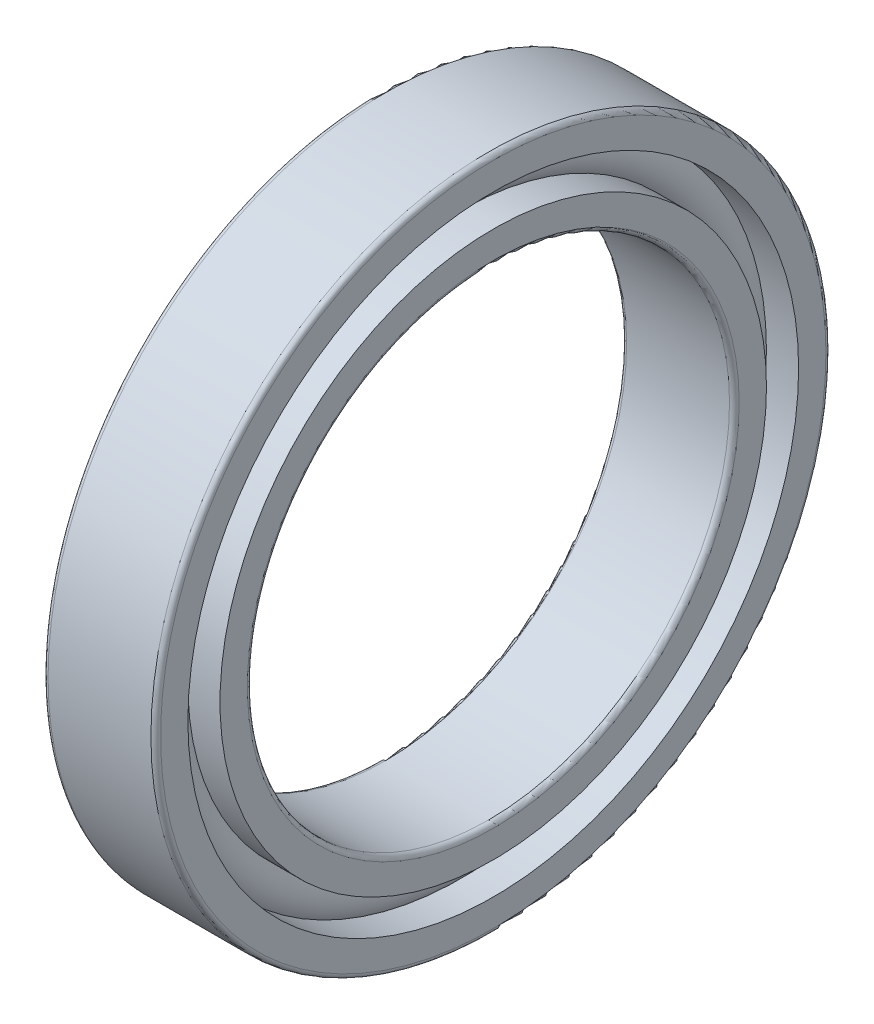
ISO-10303-21;
HEADER;
FILE_DESCRIPTION(('STEP AP214'),'2;1');
FILE_NAME('part.step','',(''),(''),'','','');
FILE_SCHEMA(('AUTOMOTIVE_DESIGN { 1 0 10303 214 1 1 1 1 }'));
ENDSEC;
DATA;
#1=APPLICATION_CONTEXT('core data for automotive mechanical design processes');
#2=APPLICATION_PROTOCOL_DEFINITION('international standard','automotive_design',2000,#1);
#3=PRODUCT_CONTEXT('',#1,'mechanical');
#4=PRODUCT('Part','Part','',(#3));
#5=PRODUCT_RELATED_PRODUCT_CATEGORY('part','',(#4));
#6=PRODUCT_DEFINITION_FORMATION('','',#4);
#7=PRODUCT_DEFINITION_CONTEXT('part definition',#1,'design');
#8=PRODUCT_DEFINITION('design','',#6,#7);
#9=PRODUCT_DEFINITION_SHAPE('','',#8);
#10=(LENGTH_UNIT() NAMED_UNIT(*) SI_UNIT(.MILLI.,.METRE.));
#11=(NAMED_UNIT(*) PLANE_ANGLE_UNIT() SI_UNIT($,.RADIAN.));
#12=(NAMED_UNIT(*) SI_UNIT($,.STERADIAN.) SOLID_ANGLE_UNIT());
#13=UNCERTAINTY_MEASURE_WITH_UNIT(LENGTH_MEASURE(1.E-05),#10,'distance_accuracy_value','');
#14=(GEOMETRIC_REPRESENTATION_CONTEXT(3) GLOBAL_UNCERTAINTY_ASSIGNED_CONTEXT((#13)) GLOBAL_UNIT_ASSIGNED_CONTEXT((#10,
#11,#12)) REPRESENTATION_CONTEXT('',''));
#15=CARTESIAN_POINT('',(0.,0.,0.));
#16=DIRECTION('',(0.,0.,1.));
#17=DIRECTION('',(1.,0.,0.));
#18=AXIS2_PLACEMENT_3D('',#15,#16,#17);
#19=CARTESIAN_POINT('',(0.29999999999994,0.,0.));
#20=DIRECTION('',(1.,0.,0.));
#21=DIRECTION('',(0.,0.,-1.));
#22=AXIS2_PLACEMENT_3D('',#19,#20,#21);
#23=TOROIDAL_SURFACE('',#22,20.7000000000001,0.29999999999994);
#24=CARTESIAN_POINT('',(0.,0.,0.));
#25=DIRECTION('',(1.,0.,0.));
#26=DIRECTION('',(0.,0.,-1.));
#27=AXIS2_PLACEMENT_3D('',#24,#25,#26);
#28=CIRCLE('',#27,20.7);
#29=CARTESIAN_POINT('',(0.,0.,-20.7));
#30=VERTEX_POINT('',#29);
#31=EDGE_CURVE('E10',#30,#30,#28,.T.);
#32=ORIENTED_EDGE('',*,*,#31,.T.);
#33=EDGE_LOOP('',(#32));
#34=FACE_BOUND('',#33,.T.);
#35=CARTESIAN_POINT('',(0.3,0.,0.));
#36=DIRECTION('',(1.,0.,0.));
#37=DIRECTION('',(0.,0.,-1.));
#38=AXIS2_PLACEMENT_3D('',#35,#36,#37);
#39=CIRCLE('',#38,21.);
#40=CARTESIAN_POINT('',(0.3,0.,-21.));
#41=VERTEX_POINT('',#40);
#42=EDGE_CURVE('E81',#41,#41,#39,.T.);
#43=ORIENTED_EDGE('',*,*,#42,.F.);
#44=EDGE_LOOP('',(#43));
#45=FACE_BOUND('',#44,.T.);
#46=ADVANCED_FACE('F29',(#34,#45),#23,.T.);
#47=CARTESIAN_POINT('',(0.,20.7,0.));
#48=DIRECTION('',(-1.,0.,0.));
#49=DIRECTION('',(0.,0.,1.));
#50=AXIS2_PLACEMENT_3D('',#47,#48,#49);
#51=PLANE('',#50);
#52=CARTESIAN_POINT('',(0.,0.,0.));
#53=DIRECTION('',(1.,0.,0.));
#54=DIRECTION('',(0.,0.,-1.));
#55=AXIS2_PLACEMENT_3D('',#52,#53,#54);
#56=CIRCLE('',#55,19.);
#57=CARTESIAN_POINT('',(0.,0.,-19.));
#58=VERTEX_POINT('',#57);
#59=EDGE_CURVE('E35',#58,#58,#56,.T.);
#60=ORIENTED_EDGE('',*,*,#59,.T.);
#61=EDGE_LOOP('',(#60));
#62=FACE_BOUND('',#61,.T.);
#63=ORIENTED_EDGE('',*,*,#31,.F.);
#64=EDGE_LOOP('',(#63));
#65=FACE_BOUND('',#64,.T.);
#66=ADVANCED_FACE('F89',(#62,#65),#51,.T.);
#67=CARTESIAN_POINT('',(7.,0.,0.));
#68=DIRECTION('',(1.,0.,0.));
#69=DIRECTION('',(0.,0.,-1.));
#70=AXIS2_PLACEMENT_3D('',#67,#68,#69);
#71=CYLINDRICAL_SURFACE('',#70,19.);
#72=CARTESIAN_POINT('',(2.0033370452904,0.,0.));
#73=DIRECTION('',(1.,0.,0.));
#74=DIRECTION('',(0.,0.,-1.));
#75=AXIS2_PLACEMENT_3D('',#72,#73,#74);
#76=CIRCLE('',#75,19.);
#77=CARTESIAN_POINT('',(2.0033370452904,0.,-19.));
#78=VERTEX_POINT('',#77);
#79=EDGE_CURVE('E39',#78,#78,#76,.T.);
#80=ORIENTED_EDGE('',*,*,#79,.T.);
#81=EDGE_LOOP('',(#80));
#82=FACE_BOUND('',#81,.T.);
#83=ORIENTED_EDGE('',*,*,#59,.F.);
#84=EDGE_LOOP('',(#83));
#85=FACE_BOUND('',#84,.T.);
#86=ADVANCED_FACE('F93',(#82,#85),#71,.F.);
#87=CARTESIAN_POINT('',(3.50000000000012,0.,0.));
#88=DIRECTION('',(1.,0.,0.));
#89=DIRECTION('',(0.,0.,-1.));
#90=AXIS2_PLACEMENT_3D('',#87,#88,#89);
#91=TOROIDAL_SURFACE('',#90,18.,1.80000000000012);
#92=CARTESIAN_POINT('',(2.0033370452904,0.,0.));
#93=DIRECTION('',(1.,0.,0.));
#94=DIRECTION('',(0.,0.,-1.));
#95=AXIS2_PLACEMENT_3D('',#92,#93,#94);
#96=CIRCLE('',#95,17.);
#97=CARTESIAN_POINT('',(2.0033370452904,0.,-17.));
#98=VERTEX_POINT('',#97);
#99=EDGE_CURVE('E43',#98,#98,#96,.T.);
#100=ORIENTED_EDGE('',*,*,#99,.T.);
#101=EDGE_LOOP('',(#100));
#102=FACE_BOUND('',#101,.T.);
#103=ORIENTED_EDGE('',*,*,#79,.F.);
#104=EDGE_LOOP('',(#103));
#105=FACE_BOUND('',#104,.T.);
#106=ADVANCED_FACE('F97',(#102,#105),#91,.T.);
#107=CARTESIAN_POINT('',(7.,0.,0.));
#108=DIRECTION('',(1.,0.,0.));
#109=DIRECTION('',(0.,0.,-1.));
#110=AXIS2_PLACEMENT_3D('',#107,#108,#109);
#111=CYLINDRICAL_SURFACE('',#110,17.);
#112=CARTESIAN_POINT('',(0.,0.,0.));
#113=DIRECTION('',(1.,0.,0.));
#114=DIRECTION('',(0.,0.,-1.));
#115=AXIS2_PLACEMENT_3D('',#112,#113,#114);
#116=CIRCLE('',#115,17.);
#117=CARTESIAN_POINT('',(0.,0.,-17.));
#118=VERTEX_POINT('',#117);
#119=EDGE_CURVE('E48',#118,#118,#116,.T.);
#120=ORIENTED_EDGE('',*,*,#119,.T.);
#121=EDGE_LOOP('',(#120));
#122=FACE_BOUND('',#121,.T.);
#123=ORIENTED_EDGE('',*,*,#99,.F.);
#124=EDGE_LOOP('',(#123));
#125=FACE_BOUND('',#124,.T.);
#126=ADVANCED_FACE('F104',(#122,#125),#111,.T.);
#127=CARTESIAN_POINT('',(0.,17.,0.));
#128=DIRECTION('',(-1.,0.,0.));
#129=DIRECTION('',(0.,0.,1.));
#130=AXIS2_PLACEMENT_3D('',#127,#128,#129);
#131=PLANE('',#130);
#132=CARTESIAN_POINT('',(0.,0.,0.));
#133=DIRECTION('',(1.,0.,0.));
#134=DIRECTION('',(0.,0.,-1.));
#135=AXIS2_PLACEMENT_3D('',#132,#133,#134);
#136=CIRCLE('',#135,15.3);
#137=CARTESIAN_POINT('',(0.,0.,-15.3));
#138=VERTEX_POINT('',#137);
#139=EDGE_CURVE('E51',#138,#138,#136,.T.);
#140=ORIENTED_EDGE('',*,*,#139,.T.);
#141=EDGE_LOOP('',(#140));
#142=FACE_BOUND('',#141,.T.);
#143=ORIENTED_EDGE('',*,*,#119,.F.);
#144=EDGE_LOOP('',(#143));
#145=FACE_BOUND('',#144,.T.);
#146=ADVANCED_FACE('F108',(#142,#145),#131,.T.);
#147=CARTESIAN_POINT('',(0.299999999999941,0.,0.));
#148=DIRECTION('',(1.,0.,0.));
#149=DIRECTION('',(0.,0.,-1.));
#150=AXIS2_PLACEMENT_3D('',#147,#148,#149);
#151=TOROIDAL_SURFACE('',#150,15.2999999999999,0.299999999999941);
#152=CARTESIAN_POINT('',(0.3,0.,0.));
#153=DIRECTION('',(1.,0.,0.));
#154=DIRECTION('',(0.,0.,-1.));
#155=AXIS2_PLACEMENT_3D('',#152,#153,#154);
#156=CIRCLE('',#155,15.);
#157=CARTESIAN_POINT('',(0.3,0.,-15.));
#158=VERTEX_POINT('',#157);
#159=EDGE_CURVE('E54',#158,#158,#156,.T.);
#160=ORIENTED_EDGE('',*,*,#159,.T.);
#161=EDGE_LOOP('',(#160));
#162=FACE_BOUND('',#161,.T.);
#163=ORIENTED_EDGE('',*,*,#139,.F.);
#164=EDGE_LOOP('',(#163));
#165=FACE_BOUND('',#164,.T.);
#166=ADVANCED_FACE('F112',(#162,#165),#151,.T.);
#167=CARTESIAN_POINT('',(7.,0.,0.));
#168=DIRECTION('',(1.,0.,0.));
#169=DIRECTION('',(0.,0.,-1.));
#170=AXIS2_PLACEMENT_3D('',#167,#168,#169);
#171=CYLINDRICAL_SURFACE('',#170,15.);
#172=CARTESIAN_POINT('',(6.7,0.,0.));
#173=DIRECTION('',(1.,0.,0.));
#174=DIRECTION('',(0.,0.,-1.));
#175=AXIS2_PLACEMENT_3D('',#172,#173,#174);
#176=CIRCLE('',#175,15.);
#177=CARTESIAN_POINT('',(6.7,0.,-15.));
#178=VERTEX_POINT('',#177);
#179=EDGE_CURVE('E57',#178,#178,#176,.T.);
#180=ORIENTED_EDGE('',*,*,#179,.T.);
#181=EDGE_LOOP('',(#180));
#182=FACE_BOUND('',#181,.T.);
#183=ORIENTED_EDGE('',*,*,#159,.F.);
#184=EDGE_LOOP('',(#183));
#185=FACE_BOUND('',#184,.T.);
#186=ADVANCED_FACE('F116',(#182,#185),#171,.F.);
#187=CARTESIAN_POINT('',(6.70000000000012,0.,0.));
#188=DIRECTION('',(1.,0.,0.));
#189=DIRECTION('',(0.,0.,-1.));
#190=AXIS2_PLACEMENT_3D('',#187,#188,#189);
#191=TOROIDAL_SURFACE('',#190,15.2999999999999,0.29999999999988);
#192=CARTESIAN_POINT('',(7.,0.,0.));
#193=DIRECTION('',(1.,0.,0.));
#194=DIRECTION('',(0.,0.,-1.));
#195=AXIS2_PLACEMENT_3D('',#192,#193,#194);
#196=CIRCLE('',#195,15.3);
#197=CARTESIAN_POINT('',(7.,0.,-15.3));
#198=VERTEX_POINT('',#197);
#199=EDGE_CURVE('E60',#198,#198,#196,.T.);
#200=ORIENTED_EDGE('',*,*,#199,.T.);
#201=EDGE_LOOP('',(#200));
#202=FACE_BOUND('',#201,.T.);
#203=ORIENTED_EDGE('',*,*,#179,.F.);
#204=EDGE_LOOP('',(#203));
#205=FACE_BOUND('',#204,.T.);
#206=ADVANCED_FACE('F120',(#202,#205),#191,.T.);
#207=CARTESIAN_POINT('',(7.,15.3,0.));
#208=DIRECTION('',(1.,0.,0.));
#209=DIRECTION('',(0.,0.,-1.));
#210=AXIS2_PLACEMENT_3D('',#207,#208,#209);
#211=PLANE('',#210);
#212=CARTESIAN_POINT('',(7.,0.,0.));
#213=DIRECTION('',(1.,0.,0.));
#214=DIRECTION('',(0.,0.,-1.));
#215=AXIS2_PLACEMENT_3D('',#212,#213,#214);
#216=CIRCLE('',#215,17.);
#217=CARTESIAN_POINT('',(7.,0.,-17.));
#218=VERTEX_POINT('',#217);
#219=EDGE_CURVE('E63',#218,#218,#216,.T.);
#220=ORIENTED_EDGE('',*,*,#219,.T.);
#221=EDGE_LOOP('',(#220));
#222=FACE_BOUND('',#221,.T.);
#223=ORIENTED_EDGE('',*,*,#199,.F.);
#224=EDGE_LOOP('',(#223));
#225=FACE_BOUND('',#224,.T.);
#226=ADVANCED_FACE('F124',(#222,#225),#211,.T.);
#227=CARTESIAN_POINT('',(7.,0.,0.));
#228=DIRECTION('',(1.,0.,0.));
#229=DIRECTION('',(0.,0.,-1.));
#230=AXIS2_PLACEMENT_3D('',#227,#228,#229);
#231=CYLINDRICAL_SURFACE('',#230,17.);
#232=CARTESIAN_POINT('',(4.9966629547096,0.,0.));
#233=DIRECTION('',(1.,0.,0.));
#234=DIRECTION('',(0.,0.,-1.));
#235=AXIS2_PLACEMENT_3D('',#232,#233,#234);
#236=CIRCLE('',#235,17.);
#237=CARTESIAN_POINT('',(4.9966629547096,0.,-17.));
#238=VERTEX_POINT('',#237);
#239=EDGE_CURVE('E66',#238,#238,#236,.T.);
#240=ORIENTED_EDGE('',*,*,#239,.T.);
#241=EDGE_LOOP('',(#240));
#242=FACE_BOUND('',#241,.T.);
#243=ORIENTED_EDGE('',*,*,#219,.F.);
#244=EDGE_LOOP('',(#243));
#245=FACE_BOUND('',#244,.T.);
#246=ADVANCED_FACE('F128',(#242,#245),#231,.T.);
#247=CARTESIAN_POINT('',(3.50000000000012,0.,0.));
#248=DIRECTION('',(1.,0.,0.));
#249=DIRECTION('',(0.,0.,-1.));
#250=AXIS2_PLACEMENT_3D('',#247,#248,#249);
#251=TOROIDAL_SURFACE('',#250,18.,1.79999999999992);
#252=CARTESIAN_POINT('',(4.9966629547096,0.,0.));
#253=DIRECTION('',(1.,0.,0.));
#254=DIRECTION('',(0.,0.,-1.));
#255=AXIS2_PLACEMENT_3D('',#252,#253,#254);
#256=CIRCLE('',#255,19.);
#257=CARTESIAN_POINT('',(4.9966629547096,0.,-19.));
#258=VERTEX_POINT('',#257);
#259=EDGE_CURVE('E69',#258,#258,#256,.T.);
#260=ORIENTED_EDGE('',*,*,#259,.T.);
#261=EDGE_LOOP('',(#260));
#262=FACE_BOUND('',#261,.T.);
#263=ORIENTED_EDGE('',*,*,#239,.F.);
#264=EDGE_LOOP('',(#263));
#265=FACE_BOUND('',#264,.T.);
#266=ADVANCED_FACE('F132',(#262,#265),#251,.T.);
#267=CARTESIAN_POINT('',(7.,0.,0.));
#268=DIRECTION('',(1.,0.,0.));
#269=DIRECTION('',(0.,0.,-1.));
#270=AXIS2_PLACEMENT_3D('',#267,#268,#269);
#271=CYLINDRICAL_SURFACE('',#270,19.);
#272=CARTESIAN_POINT('',(7.,0.,0.));
#273=DIRECTION('',(1.,0.,0.));
#274=DIRECTION('',(0.,0.,-1.));
#275=AXIS2_PLACEMENT_3D('',#272,#273,#274);
#276=CIRCLE('',#275,19.);
#277=CARTESIAN_POINT('',(7.,0.,-19.));
#278=VERTEX_POINT('',#277);
#279=EDGE_CURVE('E72',#278,#278,#276,.T.);
#280=ORIENTED_EDGE('',*,*,#279,.T.);
#281=EDGE_LOOP('',(#280));
#282=FACE_BOUND('',#281,.T.);
#283=ORIENTED_EDGE('',*,*,#259,.F.);
#284=EDGE_LOOP('',(#283));
#285=FACE_BOUND('',#284,.T.);
#286=ADVANCED_FACE('F136',(#282,#285),#271,.F.);
#287=CARTESIAN_POINT('',(7.,19.,0.));
#288=DIRECTION('',(1.,0.,0.));
#289=DIRECTION('',(0.,0.,-1.));
#290=AXIS2_PLACEMENT_3D('',#287,#288,#289);
#291=PLANE('',#290);
#292=CARTESIAN_POINT('',(7.,0.,0.));
#293=DIRECTION('',(1.,0.,0.));
#294=DIRECTION('',(0.,0.,-1.));
#295=AXIS2_PLACEMENT_3D('',#292,#293,#294);
#296=CIRCLE('',#295,20.7);
#297=CARTESIAN_POINT('',(7.,0.,-20.7));
#298=VERTEX_POINT('',#297);
#299=EDGE_CURVE('E75',#298,#298,#296,.T.);
#300=ORIENTED_EDGE('',*,*,#299,.T.);
#301=EDGE_LOOP('',(#300));
#302=FACE_BOUND('',#301,.T.);
#303=ORIENTED_EDGE('',*,*,#279,.F.);
#304=EDGE_LOOP('',(#303));
#305=FACE_BOUND('',#304,.T.);
#306=ADVANCED_FACE('F140',(#302,#305),#291,.T.);
#307=CARTESIAN_POINT('',(6.70000000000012,0.,0.));
#308=DIRECTION('',(1.,0.,0.));
#309=DIRECTION('',(0.,0.,-1.));
#310=AXIS2_PLACEMENT_3D('',#307,#308,#309);
#311=TOROIDAL_SURFACE('',#310,20.7000000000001,0.29999999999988);
#312=CARTESIAN_POINT('',(6.7,0.,0.));
#313=DIRECTION('',(1.,0.,0.));
#314=DIRECTION('',(0.,0.,-1.));
#315=AXIS2_PLACEMENT_3D('',#312,#313,#314);
#316=CIRCLE('',#315,21.);
#317=CARTESIAN_POINT('',(6.7,0.,-21.));
#318=VERTEX_POINT('',#317);
#319=EDGE_CURVE('E78',#318,#318,#316,.T.);
#320=ORIENTED_EDGE('',*,*,#319,.T.);
#321=EDGE_LOOP('',(#320));
#322=FACE_BOUND('',#321,.T.);
#323=ORIENTED_EDGE('',*,*,#299,.F.);
#324=EDGE_LOOP('',(#323));
#325=FACE_BOUND('',#324,.T.);
#326=ADVANCED_FACE('F144',(#322,#325),#311,.T.);
#327=CARTESIAN_POINT('',(7.,0.,0.));
#328=DIRECTION('',(1.,0.,0.));
#329=DIRECTION('',(0.,0.,-1.));
#330=AXIS2_PLACEMENT_3D('',#327,#328,#329);
#331=CYLINDRICAL_SURFACE('',#330,21.);
#332=ORIENTED_EDGE('',*,*,#42,.T.);
#333=EDGE_LOOP('',(#332));
#334=FACE_BOUND('',#333,.T.);
#335=ORIENTED_EDGE('',*,*,#319,.F.);
#336=EDGE_LOOP('',(#335));
#337=FACE_BOUND('',#336,.T.);
#338=ADVANCED_FACE('F85',(#334,#337),#331,.T.);
#339=CLOSED_SHELL('',(#46,#66,#86,#106,#126,#146,#166,#186,#206,#226,#246,#266,#286,#306,#326,#338));
#340=MANIFOLD_SOLID_BREP('B2',#339);
#341=ADVANCED_BREP_SHAPE_REPRESENTATION('',(#18,#340),#14);
#342=SHAPE_DEFINITION_REPRESENTATION(#9,#341);
ENDSEC;
END-ISO-10303-21;
